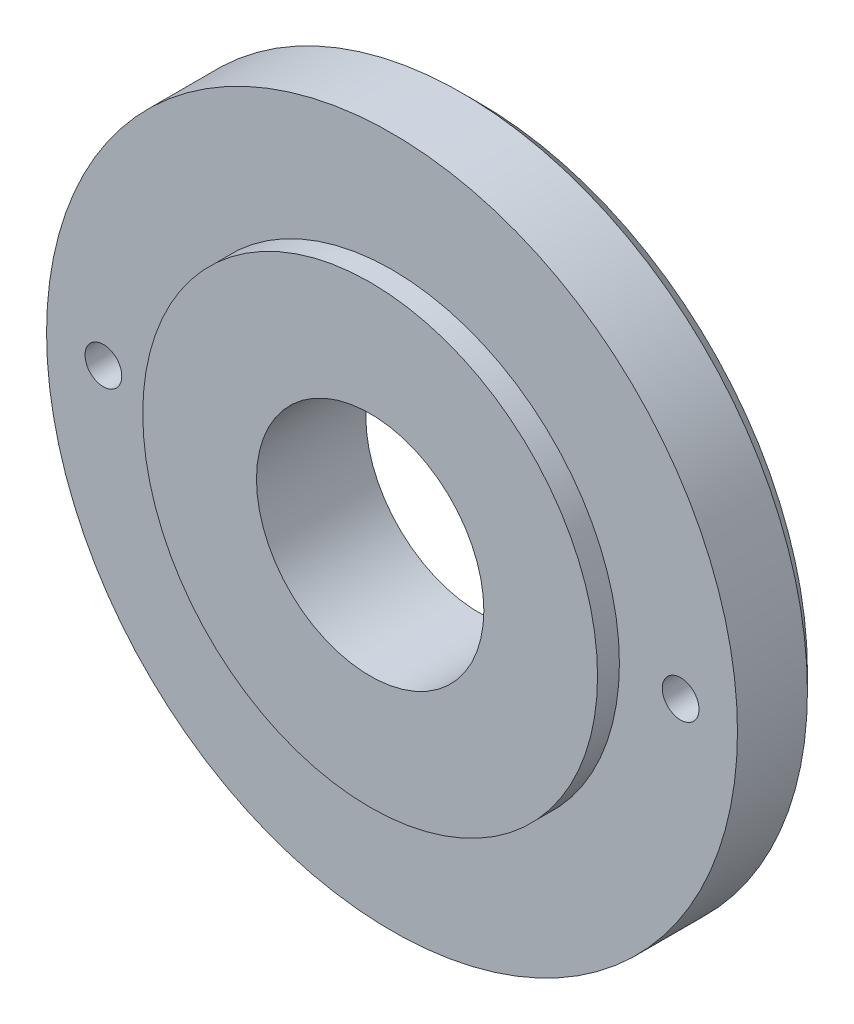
ISO-10303-21;
HEADER;
FILE_DESCRIPTION(('STEP AP214'),'2;1');
FILE_NAME('part.step','',(''),(''),'','','');
FILE_SCHEMA(('AUTOMOTIVE_DESIGN { 1 0 10303 214 1 1 1 1 }'));
ENDSEC;
DATA;
#1=APPLICATION_CONTEXT('core data for automotive mechanical design processes');
#2=APPLICATION_PROTOCOL_DEFINITION('international standard','automotive_design',2000,#1);
#3=PRODUCT_CONTEXT('',#1,'mechanical');
#4=PRODUCT('Part','Part','',(#3));
#5=PRODUCT_RELATED_PRODUCT_CATEGORY('part','',(#4));
#6=PRODUCT_DEFINITION_FORMATION('','',#4);
#7=PRODUCT_DEFINITION_CONTEXT('part definition',#1,'design');
#8=PRODUCT_DEFINITION('design','',#6,#7);
#9=PRODUCT_DEFINITION_SHAPE('','',#8);
#10=(LENGTH_UNIT() NAMED_UNIT(*) SI_UNIT(.MILLI.,.METRE.));
#11=(NAMED_UNIT(*) PLANE_ANGLE_UNIT() SI_UNIT($,.RADIAN.));
#12=(NAMED_UNIT(*) SI_UNIT($,.STERADIAN.) SOLID_ANGLE_UNIT());
#13=UNCERTAINTY_MEASURE_WITH_UNIT(LENGTH_MEASURE(1.E-05),#10,'distance_accuracy_value','');
#14=(GEOMETRIC_REPRESENTATION_CONTEXT(3) GLOBAL_UNCERTAINTY_ASSIGNED_CONTEXT((#13)) GLOBAL_UNIT_ASSIGNED_CONTEXT((#10,
#11,#12)) REPRESENTATION_CONTEXT('',''));
#15=CARTESIAN_POINT('',(0.,0.,0.));
#16=DIRECTION('',(0.,0.,1.));
#17=DIRECTION('',(1.,0.,0.));
#18=AXIS2_PLACEMENT_3D('',#15,#16,#17);
#19=CARTESIAN_POINT('',(0.,0.,10.));
#20=DIRECTION('',(0.,0.,1.));
#21=DIRECTION('',(1.,0.,0.));
#22=AXIS2_PLACEMENT_3D('',#19,#20,#21);
#23=PLANE('',#22);
#24=CARTESIAN_POINT('',(33.,0.,10.));
#25=DIRECTION('',(0.,0.,1.));
#26=DIRECTION('',(1.,0.,0.));
#27=AXIS2_PLACEMENT_3D('',#24,#25,#26);
#28=CIRCLE('',#27,2.1);
#29=CARTESIAN_POINT('',(35.1,0.,10.));
#30=VERTEX_POINT('',#29);
#31=EDGE_CURVE('E63',#30,#30,#28,.T.);
#32=ORIENTED_EDGE('',*,*,#31,.F.);
#33=EDGE_LOOP('',(#32));
#34=FACE_BOUND('',#33,.T.);
#35=CARTESIAN_POINT('',(-33.,0.,10.));
#36=DIRECTION('',(0.,0.,1.));
#37=DIRECTION('',(1.,0.,0.));
#38=AXIS2_PLACEMENT_3D('',#35,#36,#37);
#39=CIRCLE('',#38,2.1);
#40=CARTESIAN_POINT('',(-30.9,0.,10.));
#41=VERTEX_POINT('',#40);
#42=EDGE_CURVE('E57',#41,#41,#39,.T.);
#43=ORIENTED_EDGE('',*,*,#42,.F.);
#44=EDGE_LOOP('',(#43));
#45=FACE_BOUND('',#44,.T.);
#46=CARTESIAN_POINT('',(0.,0.,10.));
#47=DIRECTION('',(0.,0.,1.));
#48=DIRECTION('',(1.,0.,0.));
#49=AXIS2_PLACEMENT_3D('',#46,#47,#48);
#50=CIRCLE('',#49,39.5);
#51=CARTESIAN_POINT('',(39.5,0.,10.));
#52=VERTEX_POINT('',#51);
#53=EDGE_CURVE('E39',#52,#52,#50,.T.);
#54=ORIENTED_EDGE('',*,*,#53,.T.);
#55=EDGE_LOOP('',(#54));
#56=FACE_BOUND('',#55,.T.);
#57=CARTESIAN_POINT('',(0.,0.,10.));
#58=DIRECTION('',(0.,0.,1.));
#59=DIRECTION('',(1.,0.,0.));
#60=AXIS2_PLACEMENT_3D('',#57,#58,#59);
#61=CIRCLE('',#60,26.);
#62=CARTESIAN_POINT('',(26.,0.,10.));
#63=VERTEX_POINT('',#62);
#64=EDGE_CURVE('E51',#63,#63,#61,.T.);
#65=ORIENTED_EDGE('',*,*,#64,.F.);
#66=EDGE_LOOP('',(#65));
#67=FACE_BOUND('',#66,.T.);
#68=ADVANCED_FACE('F28',(#34,#45,#56,#67),#23,.T.);
#69=CARTESIAN_POINT('',(0.,0.,0.));
#70=DIRECTION('',(0.,0.,1.));
#71=DIRECTION('',(1.,0.,0.));
#72=AXIS2_PLACEMENT_3D('',#69,#70,#71);
#73=PLANE('',#72);
#74=CARTESIAN_POINT('',(33.,0.,0.));
#75=DIRECTION('',(0.,0.,-1.));
#76=DIRECTION('',(-1.,0.,0.));
#77=AXIS2_PLACEMENT_3D('',#74,#75,#76);
#78=CIRCLE('',#77,2.1);
#79=CARTESIAN_POINT('',(30.9,0.,0.));
#80=VERTEX_POINT('',#79);
#81=EDGE_CURVE('E66',#80,#80,#78,.T.);
#82=ORIENTED_EDGE('',*,*,#81,.F.);
#83=EDGE_LOOP('',(#82));
#84=FACE_BOUND('',#83,.T.);
#85=CARTESIAN_POINT('',(-33.,0.,0.));
#86=DIRECTION('',(0.,0.,-1.));
#87=DIRECTION('',(-1.,0.,0.));
#88=AXIS2_PLACEMENT_3D('',#85,#86,#87);
#89=CIRCLE('',#88,2.1);
#90=CARTESIAN_POINT('',(-35.1,0.,0.));
#91=VERTEX_POINT('',#90);
#92=EDGE_CURVE('E60',#91,#91,#89,.T.);
#93=ORIENTED_EDGE('',*,*,#92,.F.);
#94=EDGE_LOOP('',(#93));
#95=FACE_BOUND('',#94,.T.);
#96=CARTESIAN_POINT('',(0.,0.,0.));
#97=DIRECTION('',(0.,0.,1.));
#98=DIRECTION('',(1.,0.,0.));
#99=AXIS2_PLACEMENT_3D('',#96,#97,#98);
#100=CIRCLE('',#99,37.5);
#101=CARTESIAN_POINT('',(37.5,0.,0.));
#102=VERTEX_POINT('',#101);
#103=EDGE_CURVE('E10',#102,#102,#100,.F.);
#104=ORIENTED_EDGE('',*,*,#103,.T.);
#105=EDGE_LOOP('',(#104));
#106=FACE_BOUND('',#105,.T.);
#107=CARTESIAN_POINT('',(0.,0.,0.));
#108=DIRECTION('',(0.,0.,1.));
#109=DIRECTION('',(1.,0.,0.));
#110=AXIS2_PLACEMENT_3D('',#107,#108,#109);
#111=CIRCLE('',#110,13.);
#112=CARTESIAN_POINT('',(13.,0.,0.));
#113=VERTEX_POINT('',#112);
#114=EDGE_CURVE('E43',#113,#113,#111,.T.);
#115=ORIENTED_EDGE('',*,*,#114,.T.);
#116=EDGE_LOOP('',(#115));
#117=FACE_BOUND('',#116,.T.);
#118=ADVANCED_FACE('F72',(#84,#95,#106,#117),#73,.F.);
#119=CARTESIAN_POINT('',(0.,0.,10.));
#120=DIRECTION('',(0.,0.,-1.));
#121=DIRECTION('',(-1.,0.,0.));
#122=AXIS2_PLACEMENT_3D('',#119,#120,#121);
#123=CYLINDRICAL_SURFACE('',#122,39.5);
#124=CARTESIAN_POINT('',(0.,0.,2.00000000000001));
#125=DIRECTION('',(0.,0.,1.));
#126=DIRECTION('',(1.,0.,0.));
#127=AXIS2_PLACEMENT_3D('',#124,#125,#126);
#128=CIRCLE('',#127,39.5);
#129=CARTESIAN_POINT('',(39.5,0.,2.00000000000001));
#130=VERTEX_POINT('',#129);
#131=EDGE_CURVE('E35',#130,#130,#128,.T.);
#132=ORIENTED_EDGE('',*,*,#131,.T.);
#133=EDGE_LOOP('',(#132));
#134=FACE_BOUND('',#133,.T.);
#135=ORIENTED_EDGE('',*,*,#53,.F.);
#136=EDGE_LOOP('',(#135));
#137=FACE_BOUND('',#136,.T.);
#138=ADVANCED_FACE('F30',(#134,#137),#123,.T.);
#139=CARTESIAN_POINT('',(0.,0.,10.));
#140=DIRECTION('',(0.,0.,-1.));
#141=DIRECTION('',(-1.,0.,0.));
#142=AXIS2_PLACEMENT_3D('',#139,#140,#141);
#143=CYLINDRICAL_SURFACE('',#142,13.);
#144=ORIENTED_EDGE('',*,*,#114,.F.);
#145=EDGE_LOOP('',(#144));
#146=FACE_BOUND('',#145,.T.);
#147=CARTESIAN_POINT('',(0.,0.,12.5));
#148=DIRECTION('',(0.,0.,1.));
#149=DIRECTION('',(1.,0.,0.));
#150=AXIS2_PLACEMENT_3D('',#147,#148,#149);
#151=CIRCLE('',#150,13.);
#152=CARTESIAN_POINT('',(13.,0.,12.5));
#153=VERTEX_POINT('',#152);
#154=EDGE_CURVE('E54',#153,#153,#151,.T.);
#155=ORIENTED_EDGE('',*,*,#154,.T.);
#156=EDGE_LOOP('',(#155));
#157=FACE_BOUND('',#156,.T.);
#158=ADVANCED_FACE('F80',(#146,#157),#143,.F.);
#159=CARTESIAN_POINT('',(0.,0.,12.5));
#160=DIRECTION('',(0.,0.,1.));
#161=DIRECTION('',(1.,0.,0.));
#162=AXIS2_PLACEMENT_3D('',#159,#160,#161);
#163=PLANE('',#162);
#164=CARTESIAN_POINT('',(0.,0.,12.5));
#165=DIRECTION('',(0.,0.,1.));
#166=DIRECTION('',(1.,0.,0.));
#167=AXIS2_PLACEMENT_3D('',#164,#165,#166);
#168=CIRCLE('',#167,26.);
#169=CARTESIAN_POINT('',(26.,0.,12.5));
#170=VERTEX_POINT('',#169);
#171=EDGE_CURVE('E48',#170,#170,#168,.T.);
#172=ORIENTED_EDGE('',*,*,#171,.T.);
#173=EDGE_LOOP('',(#172));
#174=FACE_BOUND('',#173,.T.);
#175=ORIENTED_EDGE('',*,*,#154,.F.);
#176=EDGE_LOOP('',(#175));
#177=FACE_BOUND('',#176,.T.);
#178=ADVANCED_FACE('F83',(#174,#177),#163,.T.);
#179=CARTESIAN_POINT('',(0.,0.,12.5));
#180=DIRECTION('',(0.,0.,-1.));
#181=DIRECTION('',(-1.,0.,0.));
#182=AXIS2_PLACEMENT_3D('',#179,#180,#181);
#183=CYLINDRICAL_SURFACE('',#182,26.);
#184=ORIENTED_EDGE('',*,*,#171,.F.);
#185=EDGE_LOOP('',(#184));
#186=FACE_BOUND('',#185,.T.);
#187=ORIENTED_EDGE('',*,*,#64,.T.);
#188=EDGE_LOOP('',(#187));
#189=FACE_BOUND('',#188,.T.);
#190=ADVANCED_FACE('F88',(#186,#189),#183,.T.);
#191=CARTESIAN_POINT('',(0.,0.,2.00000000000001));
#192=DIRECTION('',(0.,0.,1.));
#193=DIRECTION('',(1.,0.,0.));
#194=AXIS2_PLACEMENT_3D('',#191,#192,#193);
#195=CONICAL_SURFACE('',#194,39.5,0.78539816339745);
#196=ORIENTED_EDGE('',*,*,#103,.F.);
#197=EDGE_LOOP('',(#196));
#198=FACE_BOUND('',#197,.T.);
#199=ORIENTED_EDGE('',*,*,#131,.F.);
#200=EDGE_LOOP('',(#199));
#201=FACE_BOUND('',#200,.T.);
#202=ADVANCED_FACE('F94',(#198,#201),#195,.T.);
#203=CARTESIAN_POINT('',(-33.,0.,12.5));
#204=DIRECTION('',(0.,0.,-1.));
#205=DIRECTION('',(-1.,0.,0.));
#206=AXIS2_PLACEMENT_3D('',#203,#204,#205);
#207=CYLINDRICAL_SURFACE('',#206,2.1);
#208=ORIENTED_EDGE('',*,*,#42,.T.);
#209=EDGE_LOOP('',(#208));
#210=FACE_BOUND('',#209,.T.);
#211=ORIENTED_EDGE('',*,*,#92,.T.);
#212=EDGE_LOOP('',(#211));
#213=FACE_BOUND('',#212,.T.);
#214=ADVANCED_FACE('F141',(#210,#213),#207,.F.);
#215=CARTESIAN_POINT('',(33.,0.,12.5));
#216=DIRECTION('',(0.,0.,-1.));
#217=DIRECTION('',(-1.,0.,0.));
#218=AXIS2_PLACEMENT_3D('',#215,#216,#217);
#219=CYLINDRICAL_SURFACE('',#218,2.1);
#220=ORIENTED_EDGE('',*,*,#31,.T.);
#221=EDGE_LOOP('',(#220));
#222=FACE_BOUND('',#221,.T.);
#223=ORIENTED_EDGE('',*,*,#81,.T.);
#224=EDGE_LOOP('',(#223));
#225=FACE_BOUND('',#224,.T.);
#226=ADVANCED_FACE('F70',(#222,#225),#219,.F.);
#227=CLOSED_SHELL('',(#68,#118,#138,#158,#178,#190,#202,#214,#226));
#228=MANIFOLD_SOLID_BREP('B2',#227);
#229=ADVANCED_BREP_SHAPE_REPRESENTATION('',(#18,#228),#14);
#230=SHAPE_DEFINITION_REPRESENTATION(#9,#229);
ENDSEC;
END-ISO-10303-21;
